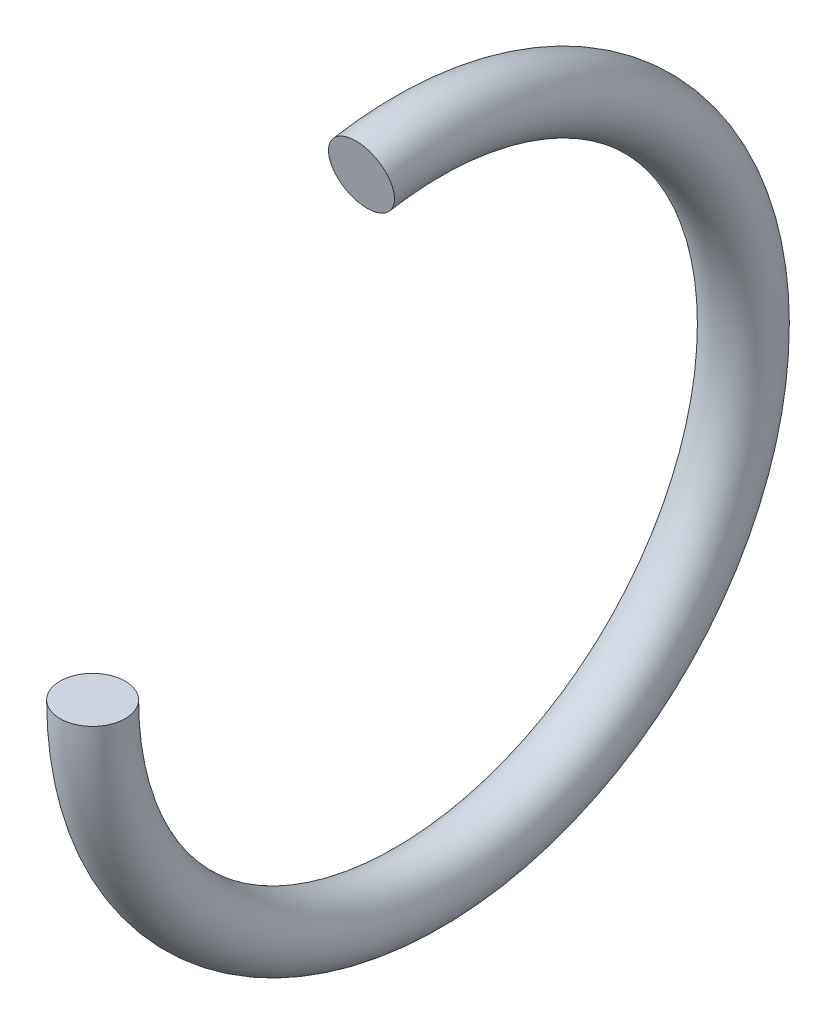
from build123d import *
from build123d.topology import SkipClean

# Parameters (mm, degrees)
ESQUISSE1_R                     = 0.25
BASE_R_VOLUTION_ANGLE           = 10
BASE_R_VOLUTION_OTHER_WAY_ANGLE = 270


with BuildPart() as part:
    # Esquisse1 → Base-R_volution (revolve)
    with BuildSketch(Plane.XY):
        with Locations((41.15, 2.5)):
            Circle(ESQUISSE1_R)
    revolve(axis=Axis((43.776690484, 0, 0), (1, 0, 0)), revolution_arc=BASE_R_VOLUTION_ANGLE)

    # Esquisse1 → Base-R_volution other way (revolve)
    with SkipClean():  # the faces are left unmerged after this step: merging them gives an invalid solid
        with BuildSketch(Plane.XY):
            with Locations((41.15, 2.5)):
                Circle(ESQUISSE1_R)
        revolve(axis=Axis((43.776690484, 0, 0), (-1, 0, 0)), revolution_arc=BASE_R_VOLUTION_OTHER_WAY_ANGLE)


solid = part.part
